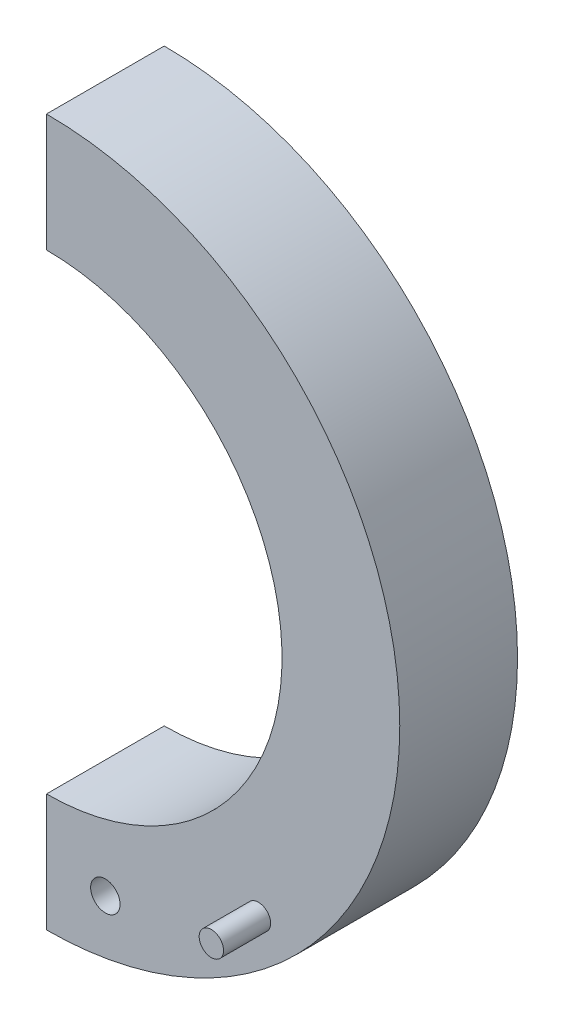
ISO-10303-21;
HEADER;
FILE_DESCRIPTION(('STEP AP214'),'2;1');
FILE_NAME('part.step','',(''),(''),'','','');
FILE_SCHEMA(('AUTOMOTIVE_DESIGN { 1 0 10303 214 1 1 1 1 }'));
ENDSEC;
DATA;
#1=APPLICATION_CONTEXT('core data for automotive mechanical design processes');
#2=APPLICATION_PROTOCOL_DEFINITION('international standard','automotive_design',2000,#1);
#3=PRODUCT_CONTEXT('',#1,'mechanical');
#4=PRODUCT('Part','Part','',(#3));
#5=PRODUCT_RELATED_PRODUCT_CATEGORY('part','',(#4));
#6=PRODUCT_DEFINITION_FORMATION('','',#4);
#7=PRODUCT_DEFINITION_CONTEXT('part definition',#1,'design');
#8=PRODUCT_DEFINITION('design','',#6,#7);
#9=PRODUCT_DEFINITION_SHAPE('','',#8);
#10=(LENGTH_UNIT() NAMED_UNIT(*) SI_UNIT(.MILLI.,.METRE.));
#11=(NAMED_UNIT(*) PLANE_ANGLE_UNIT() SI_UNIT($,.RADIAN.));
#12=(NAMED_UNIT(*) SI_UNIT($,.STERADIAN.) SOLID_ANGLE_UNIT());
#13=UNCERTAINTY_MEASURE_WITH_UNIT(LENGTH_MEASURE(1.E-05),#10,'distance_accuracy_value','');
#14=(GEOMETRIC_REPRESENTATION_CONTEXT(3) GLOBAL_UNCERTAINTY_ASSIGNED_CONTEXT((#13)) GLOBAL_UNIT_ASSIGNED_CONTEXT((#10,
#11,#12)) REPRESENTATION_CONTEXT('',''));
#15=CARTESIAN_POINT('',(0.,0.,0.));
#16=DIRECTION('',(0.,0.,1.));
#17=DIRECTION('',(1.,0.,0.));
#18=AXIS2_PLACEMENT_3D('',#15,#16,#17);
#19=CARTESIAN_POINT('',(0.,0.,6.35));
#20=DIRECTION('',(0.,0.,-1.));
#21=DIRECTION('',(-1.,0.,0.));
#22=AXIS2_PLACEMENT_3D('',#19,#20,#21);
#23=CYLINDRICAL_SURFACE('',#22,19.05);
#24=CARTESIAN_POINT('',(0.,0.,0.));
#25=DIRECTION('',(0.,0.,1.));
#26=DIRECTION('',(-1.,0.,0.));
#27=AXIS2_PLACEMENT_3D('',#24,#25,#26);
#28=CIRCLE('',#27,19.05);
#29=CARTESIAN_POINT('',(0.,-19.05,0.));
#30=VERTEX_POINT('',#29);
#31=CARTESIAN_POINT('',(0.,19.05,0.));
#32=VERTEX_POINT('',#31);
#33=EDGE_CURVE('E100',#30,#32,#28,.T.);
#34=ORIENTED_EDGE('',*,*,#33,.T.);
#35=DIRECTION('',(0.,0.,-1.));
#36=VECTOR('',#35,1.);
#37=CARTESIAN_POINT('',(0.,19.05,6.35));
#38=LINE('',#37,#36);
#39=CARTESIAN_POINT('',(0.,19.05,6.35));
#40=VERTEX_POINT('',#39);
#41=EDGE_CURVE('E42',#40,#32,#38,.T.);
#42=ORIENTED_EDGE('',*,*,#41,.F.);
#43=CARTESIAN_POINT('',(0.,0.,6.35));
#44=DIRECTION('',(0.,0.,1.));
#45=DIRECTION('',(-1.,0.,0.));
#46=AXIS2_PLACEMENT_3D('',#43,#44,#45);
#47=CIRCLE('',#46,19.05);
#48=CARTESIAN_POINT('',(0.,-19.05,6.35));
#49=VERTEX_POINT('',#48);
#50=EDGE_CURVE('E86',#49,#40,#47,.T.);
#51=ORIENTED_EDGE('',*,*,#50,.F.);
#52=DIRECTION('',(0.,0.,-1.));
#53=VECTOR('',#52,1.);
#54=CARTESIAN_POINT('',(0.,-19.05,6.35));
#55=LINE('',#54,#53);
#56=EDGE_CURVE('E96',#49,#30,#55,.T.);
#57=ORIENTED_EDGE('',*,*,#56,.T.);
#58=EDGE_LOOP('',(#34,#42,#51,#57));
#59=FACE_BOUND('',#58,.T.);
#60=ADVANCED_FACE('F33',(#59),#23,.T.);
#61=CARTESIAN_POINT('',(0.,19.05,6.35));
#62=DIRECTION('',(1.,0.,0.));
#63=DIRECTION('',(0.,1.,0.));
#64=AXIS2_PLACEMENT_3D('',#61,#62,#63);
#65=PLANE('',#64);
#66=DIRECTION('',(0.,-1.,0.));
#67=VECTOR('',#66,1.);
#68=CARTESIAN_POINT('',(0.,19.05,0.));
#69=LINE('',#68,#67);
#70=CARTESIAN_POINT('',(0.,12.7,0.));
#71=VERTEX_POINT('',#70);
#72=EDGE_CURVE('E91',#32,#71,#69,.T.);
#73=ORIENTED_EDGE('',*,*,#72,.T.);
#74=DIRECTION('',(0.,0.,-1.));
#75=VECTOR('',#74,1.);
#76=CARTESIAN_POINT('',(0.,12.7,6.35));
#77=LINE('',#76,#75);
#78=CARTESIAN_POINT('',(0.,12.7,6.35));
#79=VERTEX_POINT('',#78);
#80=EDGE_CURVE('E89',#79,#71,#77,.T.);
#81=ORIENTED_EDGE('',*,*,#80,.F.);
#82=DIRECTION('',(0.,-1.,0.));
#83=VECTOR('',#82,1.);
#84=CARTESIAN_POINT('',(0.,19.05,6.35));
#85=LINE('',#84,#83);
#86=EDGE_CURVE('E81',#40,#79,#85,.T.);
#87=ORIENTED_EDGE('',*,*,#86,.F.);
#88=ORIENTED_EDGE('',*,*,#41,.T.);
#89=EDGE_LOOP('',(#73,#81,#87,#88));
#90=FACE_BOUND('',#89,.T.);
#91=ADVANCED_FACE('F90',(#90),#65,.F.);
#92=CARTESIAN_POINT('',(0.,0.,6.35));
#93=DIRECTION('',(0.,0.,-1.));
#94=DIRECTION('',(-1.,0.,0.));
#95=AXIS2_PLACEMENT_3D('',#92,#93,#94);
#96=CYLINDRICAL_SURFACE('',#95,12.7);
#97=CARTESIAN_POINT('',(0.,0.,0.));
#98=DIRECTION('',(0.,0.,-1.));
#99=DIRECTION('',(-1.,0.,0.));
#100=AXIS2_PLACEMENT_3D('',#97,#98,#99);
#101=CIRCLE('',#100,12.7);
#102=CARTESIAN_POINT('',(0.,-12.7,0.));
#103=VERTEX_POINT('',#102);
#104=EDGE_CURVE('E67',#71,#103,#101,.T.);
#105=ORIENTED_EDGE('',*,*,#104,.T.);
#106=DIRECTION('',(0.,0.,-1.));
#107=VECTOR('',#106,1.);
#108=CARTESIAN_POINT('',(0.,-12.7,6.35));
#109=LINE('',#108,#107);
#110=CARTESIAN_POINT('',(0.,-12.7,6.35));
#111=VERTEX_POINT('',#110);
#112=EDGE_CURVE('E92',#111,#103,#109,.T.);
#113=ORIENTED_EDGE('',*,*,#112,.F.);
#114=CARTESIAN_POINT('',(0.,0.,6.35));
#115=DIRECTION('',(0.,0.,-1.));
#116=DIRECTION('',(-1.,0.,0.));
#117=AXIS2_PLACEMENT_3D('',#114,#115,#116);
#118=CIRCLE('',#117,12.7);
#119=EDGE_CURVE('E84',#79,#111,#118,.T.);
#120=ORIENTED_EDGE('',*,*,#119,.F.);
#121=ORIENTED_EDGE('',*,*,#80,.T.);
#122=EDGE_LOOP('',(#105,#113,#120,#121));
#123=FACE_BOUND('',#122,.T.);
#124=ADVANCED_FACE('F94',(#123),#96,.F.);
#125=CARTESIAN_POINT('',(0.,-12.7,6.35));
#126=DIRECTION('',(1.,0.,0.));
#127=DIRECTION('',(0.,1.,0.));
#128=AXIS2_PLACEMENT_3D('',#125,#126,#127);
#129=PLANE('',#128);
#130=DIRECTION('',(0.,-1.,0.));
#131=VECTOR('',#130,1.);
#132=CARTESIAN_POINT('',(0.,-12.7,0.));
#133=LINE('',#132,#131);
#134=EDGE_CURVE('E73',#103,#30,#133,.T.);
#135=ORIENTED_EDGE('',*,*,#134,.T.);
#136=ORIENTED_EDGE('',*,*,#56,.F.);
#137=DIRECTION('',(0.,-1.,0.));
#138=VECTOR('',#137,1.);
#139=CARTESIAN_POINT('',(0.,-12.7,6.35));
#140=LINE('',#139,#138);
#141=EDGE_CURVE('E50',#111,#49,#140,.T.);
#142=ORIENTED_EDGE('',*,*,#141,.F.);
#143=ORIENTED_EDGE('',*,*,#112,.T.);
#144=EDGE_LOOP('',(#135,#136,#142,#143));
#145=FACE_BOUND('',#144,.T.);
#146=ADVANCED_FACE('F124',(#145),#129,.F.);
#147=CARTESIAN_POINT('',(0.,0.,6.35));
#148=DIRECTION('',(0.,0.,-1.));
#149=DIRECTION('',(-1.,0.,0.));
#150=AXIS2_PLACEMENT_3D('',#147,#148,#149);
#151=PLANE('',#150);
#152=CARTESIAN_POINT('',(3.175,-15.875,6.35));
#153=DIRECTION('',(0.,0.,1.));
#154=DIRECTION('',(1.,0.,0.));
#155=AXIS2_PLACEMENT_3D('',#152,#153,#154);
#156=CIRCLE('',#155,0.79375);
#157=CARTESIAN_POINT('',(3.96875,-15.875,6.35));
#158=VERTEX_POINT('',#157);
#159=EDGE_CURVE('E211',#158,#158,#156,.T.);
#160=ORIENTED_EDGE('',*,*,#159,.F.);
#161=EDGE_LOOP('',(#160));
#162=FACE_BOUND('',#161,.T.);
#163=CARTESIAN_POINT('',(11.43,-12.7,6.35));
#164=DIRECTION('',(0.,0.,-1.));
#165=DIRECTION('',(-1.,0.,0.));
#166=AXIS2_PLACEMENT_3D('',#163,#164,#165);
#167=CIRCLE('',#166,0.657759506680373);
#168=CARTESIAN_POINT('',(10.7722404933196,-12.7,6.35));
#169=VERTEX_POINT('',#168);
#170=EDGE_CURVE('E103',#169,#169,#167,.T.);
#171=ORIENTED_EDGE('',*,*,#170,.T.);
#172=EDGE_LOOP('',(#171));
#173=FACE_BOUND('',#172,.T.);
#174=ORIENTED_EDGE('',*,*,#50,.T.);
#175=ORIENTED_EDGE('',*,*,#86,.T.);
#176=ORIENTED_EDGE('',*,*,#119,.T.);
#177=ORIENTED_EDGE('',*,*,#141,.T.);
#178=EDGE_LOOP('',(#174,#175,#176,#177));
#179=FACE_BOUND('',#178,.T.);
#180=ADVANCED_FACE('F82',(#162,#173,#179),#151,.F.);
#181=CARTESIAN_POINT('',(0.,0.,0.));
#182=DIRECTION('',(0.,0.,-1.));
#183=DIRECTION('',(-1.,0.,0.));
#184=AXIS2_PLACEMENT_3D('',#181,#182,#183);
#185=PLANE('',#184);
#186=CARTESIAN_POINT('',(3.175,-15.875,0.));
#187=DIRECTION('',(0.,0.,-1.));
#188=DIRECTION('',(-1.,0.,0.));
#189=AXIS2_PLACEMENT_3D('',#186,#187,#188);
#190=CIRCLE('',#189,0.79375);
#191=CARTESIAN_POINT('',(2.38125,-15.875,0.));
#192=VERTEX_POINT('',#191);
#193=EDGE_CURVE('E36',#192,#192,#190,.T.);
#194=ORIENTED_EDGE('',*,*,#193,.F.);
#195=EDGE_LOOP('',(#194));
#196=FACE_BOUND('',#195,.T.);
#197=CARTESIAN_POINT('',(11.43,-12.7,0.));
#198=DIRECTION('',(0.,0.,-1.));
#199=DIRECTION('',(-1.,0.,0.));
#200=AXIS2_PLACEMENT_3D('',#197,#198,#199);
#201=CIRCLE('',#200,0.657759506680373);
#202=CARTESIAN_POINT('',(10.7722404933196,-12.7,0.));
#203=VERTEX_POINT('',#202);
#204=EDGE_CURVE('E11',#203,#203,#201,.T.);
#205=ORIENTED_EDGE('',*,*,#204,.F.);
#206=EDGE_LOOP('',(#205));
#207=FACE_BOUND('',#206,.T.);
#208=ORIENTED_EDGE('',*,*,#33,.F.);
#209=ORIENTED_EDGE('',*,*,#134,.F.);
#210=ORIENTED_EDGE('',*,*,#104,.F.);
#211=ORIENTED_EDGE('',*,*,#72,.F.);
#212=EDGE_LOOP('',(#208,#209,#210,#211));
#213=FACE_BOUND('',#212,.T.);
#214=ADVANCED_FACE('F112',(#196,#207,#213),#185,.T.);
#215=CARTESIAN_POINT('',(11.43,-12.7,-2.54));
#216=DIRECTION('',(0.,0.,1.));
#217=DIRECTION('',(1.,0.,0.));
#218=AXIS2_PLACEMENT_3D('',#215,#216,#217);
#219=PLANE('',#218);
#220=CARTESIAN_POINT('',(11.43,-12.7,-2.54));
#221=DIRECTION('',(0.,0.,1.));
#222=DIRECTION('',(1.,0.,0.));
#223=AXIS2_PLACEMENT_3D('',#220,#221,#222);
#224=CIRCLE('',#223,0.657759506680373);
#225=CARTESIAN_POINT('',(12.0877595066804,-12.7,-2.54));
#226=VERTEX_POINT('',#225);
#227=EDGE_CURVE('E203',#226,#226,#224,.T.);
#228=ORIENTED_EDGE('',*,*,#227,.F.);
#229=EDGE_LOOP('',(#228));
#230=FACE_BOUND('',#229,.T.);
#231=ADVANCED_FACE('F114',(#230),#219,.F.);
#232=CARTESIAN_POINT('',(11.43,-12.7,-2.54));
#233=DIRECTION('',(0.,0.,1.));
#234=DIRECTION('',(1.,0.,0.));
#235=AXIS2_PLACEMENT_3D('',#232,#233,#234);
#236=CYLINDRICAL_SURFACE('',#235,0.657759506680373);
#237=ORIENTED_EDGE('',*,*,#204,.T.);
#238=EDGE_LOOP('',(#237));
#239=FACE_BOUND('',#238,.T.);
#240=ORIENTED_EDGE('',*,*,#227,.T.);
#241=EDGE_LOOP('',(#240));
#242=FACE_BOUND('',#241,.T.);
#243=ADVANCED_FACE('F121',(#239,#242),#236,.T.);
#244=CARTESIAN_POINT('',(11.43,-12.7,8.89));
#245=DIRECTION('',(0.,0.,1.));
#246=DIRECTION('',(1.,0.,0.));
#247=AXIS2_PLACEMENT_3D('',#244,#245,#246);
#248=CIRCLE('',#247,0.657759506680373);
#249=CARTESIAN_POINT('',(12.0877595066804,-12.7,8.89));
#250=VERTEX_POINT('',#249);
#251=EDGE_CURVE('E204',#250,#250,#248,.T.);
#252=ORIENTED_EDGE('',*,*,#251,.F.);
#253=EDGE_LOOP('',(#252));
#254=FACE_BOUND('',#253,.T.);
#255=ORIENTED_EDGE('',*,*,#170,.F.);
#256=EDGE_LOOP('',(#255));
#257=FACE_BOUND('',#256,.T.);
#258=ADVANCED_FACE('F175',(#254,#257),#236,.T.);
#259=CARTESIAN_POINT('',(11.43,-12.7,8.89));
#260=DIRECTION('',(0.,0.,1.));
#261=DIRECTION('',(1.,0.,0.));
#262=AXIS2_PLACEMENT_3D('',#259,#260,#261);
#263=PLANE('',#262);
#264=ORIENTED_EDGE('',*,*,#251,.T.);
#265=EDGE_LOOP('',(#264));
#266=FACE_BOUND('',#265,.T.);
#267=ADVANCED_FACE('F154',(#266),#263,.T.);
#268=CARTESIAN_POINT('',(3.175,-15.875,-2.54));
#269=DIRECTION('',(0.,0.,1.));
#270=DIRECTION('',(1.,0.,0.));
#271=AXIS2_PLACEMENT_3D('',#268,#269,#270);
#272=CYLINDRICAL_SURFACE('',#271,0.79375);
#273=ORIENTED_EDGE('',*,*,#193,.T.);
#274=EDGE_LOOP('',(#273));
#275=FACE_BOUND('',#274,.T.);
#276=ORIENTED_EDGE('',*,*,#159,.T.);
#277=EDGE_LOOP('',(#276));
#278=FACE_BOUND('',#277,.T.);
#279=ADVANCED_FACE('F164',(#275,#278),#272,.F.);
#280=CLOSED_SHELL('',(#60,#91,#124,#146,#180,#214,#231,#243,#258,#267,#279));
#281=MANIFOLD_SOLID_BREP('B2',#280);
#282=ADVANCED_BREP_SHAPE_REPRESENTATION('',(#18,#281),#14);
#283=SHAPE_DEFINITION_REPRESENTATION(#9,#282);
ENDSEC;
END-ISO-10303-21;
